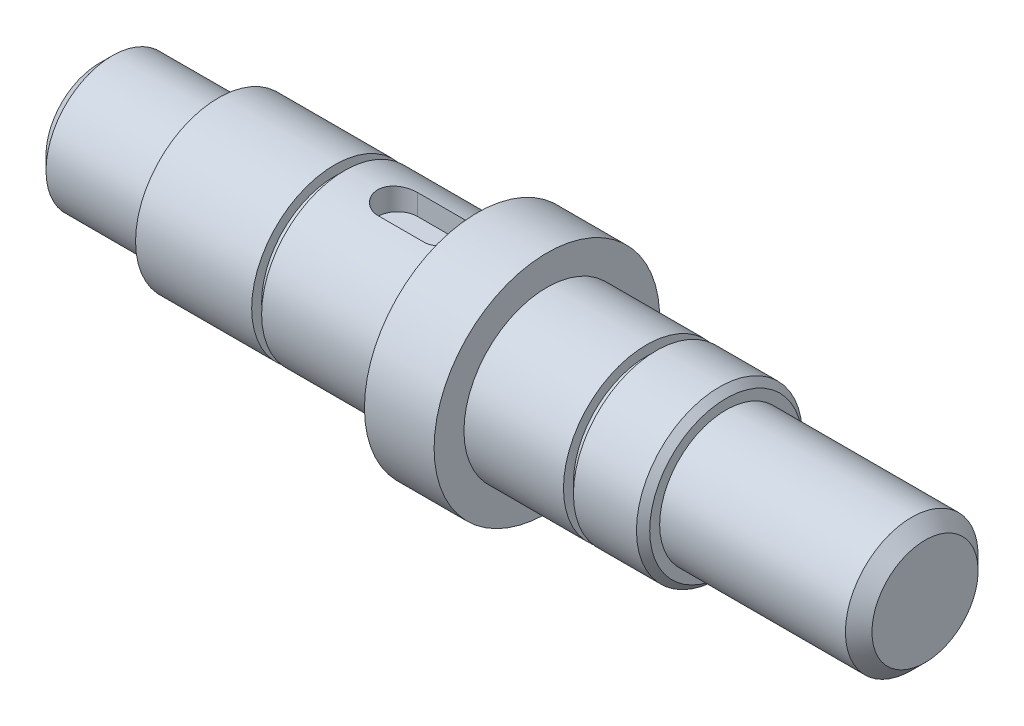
from build123d import *

# Parameters (mm, degrees)
CHANFREIN_2MM_SIZE = 2
CHANFREIN_1_SIZE   = 1
CLAVETTEA_DEPTH    = 4


with BuildPart() as part:
    # Esquisse1 → Base-R_volution (revolve)
    with BuildSketch(Plane.XY, mode=Mode.PRIVATE) as base_r_volution_sk:
        Polygon((-69.5, 0), (-69.5, 10), (-51.5, 10), (-51.5, 12.5), (-34, 12.5), (-34, 11), (-32.5, 11), (-32.5, 12.5), (-12.5, 12.5), (-12.5, 17), (-2, 17), (-2, 12.5), (13, 12.5), (13, 11), (14.5, 11), (14.5, 12.5), (25, 12.5), (25, 10), (55, 10), (55, 0), align=None)
    revolve(base_r_volution_sk.sketch.rotate(Axis((-69.5, 0, 0), (1, 0, 0)), 90), axis=Axis((-69.5, 0, 0), (1, 0, 0)))

    # Chanfrein-2mm
    chanfrein_2mm_edges = [part.edges().sort_by_distance(p)[0] for p in [
        (55, 0, -10),
        (-69.5, 0, -10),
    ]]
    chamfer(chanfrein_2mm_edges, length=CHANFREIN_2MM_SIZE)

    # Chanfrein-1
    chanfrein_1_edges = [part.edges().sort_by_distance(p)[0] for p in [
        (25, 0, -12.5),
    ]]
    chamfer(chanfrein_1_edges, length=CHANFREIN_1_SIZE)

    # Esquisse2 → clavetteA (cut)
    with BuildSketch(Plane(origin=(0, 13, 0), x_dir=(-1, 0, 0), z_dir=(0, 1, 0))):
        with BuildLine():
            Line((17.5, 3), (24.5, 3))
            ThreePointArc((24.5, 3), (27.5, 0), (24.5, -3))
            Line((24.5, -3), (17.5, -3))
            ThreePointArc((17.5, -3), (14.5, 0), (17.5, 3))
        make_face()
    extrude(amount=-CLAVETTEA_DEPTH, mode=Mode.SUBTRACT)


solid = part.part
